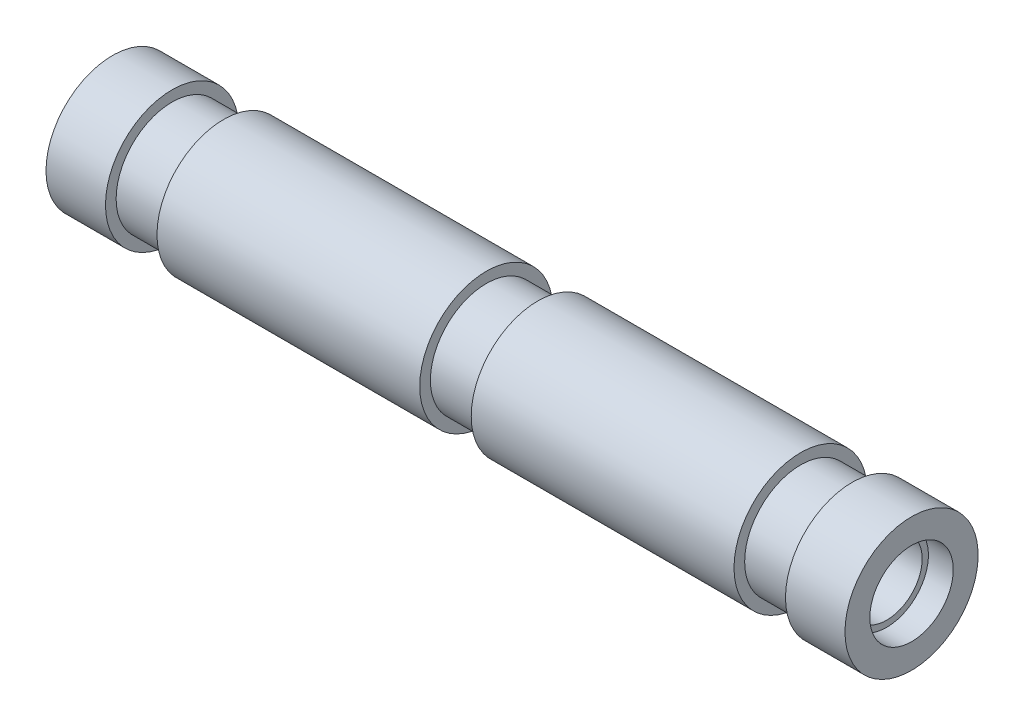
from build123d import *


with BuildPart() as part:
    # Esquisse1 → R_volution1 (revolve)
    with BuildSketch(Plane.XY, mode=Mode.PRIVATE) as r_volution1_sk:
        Polygon((-225, 23.5), (-211, 23.5), (-211, 20), (211, 20), (211, 23.5), (225, 23.5), (225, 37.5), (191.5, 37.5), (191.5, 31.5), (162.5, 31.5), (162.5, 37.5), (14.5, 37.5), (14.5, 31.5), (-14.5, 31.5), (-14.5, 37.5), (-162.5, 37.5), (-162.5, 31.5), (-191.5, 31.5), (-191.5, 37.5), (-225, 37.5), align=None)
    revolve(r_volution1_sk.sketch.rotate(Axis((-245.901988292, 0, 0), (1, 0, 0)), 90), axis=Axis((-245.901988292, 0, 0), (1, 0, 0)))


solid = part.part
